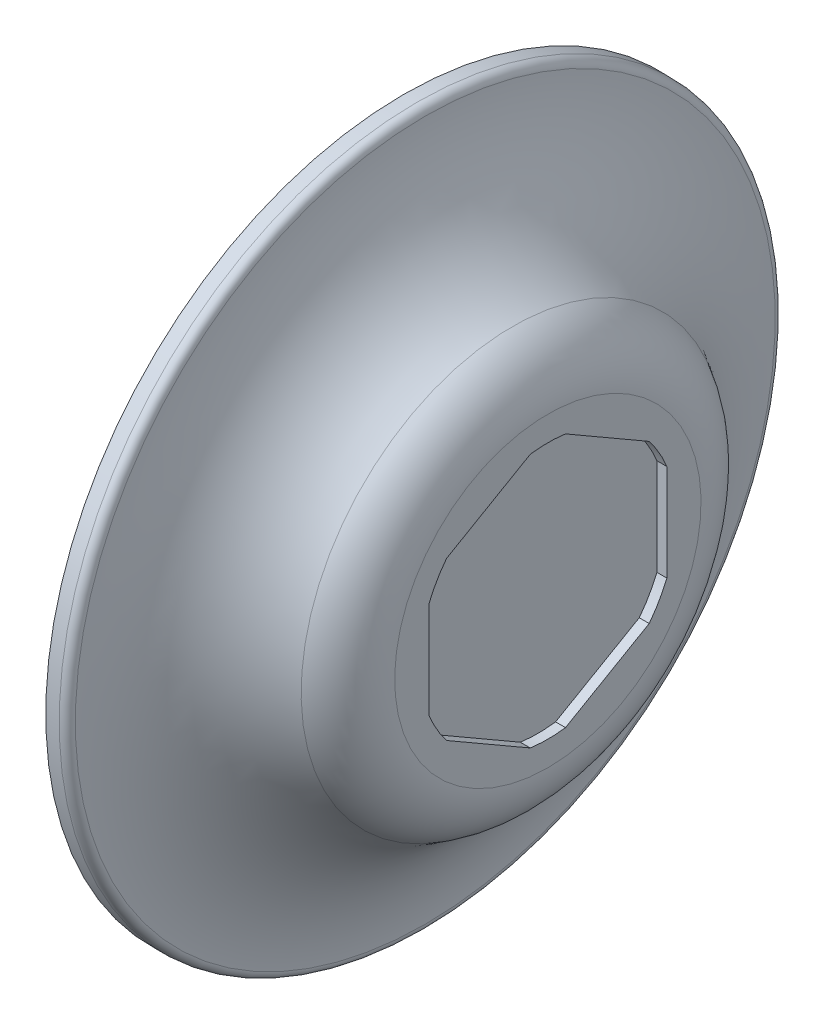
from build123d import *

# Parameters (mm, degrees)
HEX_2_DEPTH       = 0.762
SKETCH4_R         = 12.2555
BACK_RECESS_DEPTH = 0.7493
FILLET1_R         = 0.635


with BuildPart() as part:
    # Sketch1 → Main Body (revolve)
    with BuildSketch(Plane.XY, mode=Mode.PRIVATE) as main_body_sk:
        with BuildLine():
            Line((6.949434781, 0), (9.413234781, 0))
            Line((9.413234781, 0), (9.413234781, 11.743608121))
            ThreePointArc((9.413234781, 11.743608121), (8.689274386, 14.357287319), (6.723739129, 16.2260058))
            ThreePointArc((6.723739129, 16.2260058), (1.809900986, 20.897802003), (0, 27.432))
            Line((0, 27.432), (-1.651, 27.432))
            Line((-1.651, 27.432), (-1.651, 26.162))
            Line((-1.651, 26.162), (-0.395763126, 26.162))
            ThreePointArc((-0.395763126, 26.162), (1.897435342, 19.920907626), (6.949434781, 15.598027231))
            Line((6.949434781, 15.598027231), (6.949434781, 0))
        make_face()
    revolve(main_body_sk.sketch.rotate(Axis((6.949434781, 0, 0), (1, 0, 0)), 180), axis=Axis((6.949434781, 0, 0), (1, 0, 0)))

    # Sketch3 → Hex 2 (cut)
    with BuildSketch(Plane(origin=(9.413234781, 0, 0), x_dir=(0, 0, -1), z_dir=(1, 0, 0))):
        with BuildLine():
            Line((-9.1186, 3.704853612), (-9.1186, -3.704853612))
            ThreePointArc((-9.1186, -3.704853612), (-8.523855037, -4.92125), (-7.767797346, -6.044512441))
            Line((-7.767797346, -6.044512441), (-1.350802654, -9.749366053))
            ThreePointArc((-1.350802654, -9.749366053), (0, -9.8425), (1.350802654, -9.749366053))
            Line((1.350802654, -9.749366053), (7.767797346, -6.044512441))
            ThreePointArc((7.767797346, -6.044512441), (8.523855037, -4.92125), (9.1186, -3.704853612))
            Line((9.1186, -3.704853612), (9.1186, 3.704853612))
            ThreePointArc((9.1186, 3.704853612), (8.523855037, 4.92125), (7.767797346, 6.044512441))
            Line((7.767797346, 6.044512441), (1.350802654, 9.749366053))
            ThreePointArc((1.350802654, 9.749366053), (0, 9.8425), (-1.350802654, 9.749366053))
            Line((-1.350802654, 9.749366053), (-7.767797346, 6.044512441))
            ThreePointArc((-7.767797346, 6.044512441), (-8.523855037, 4.92125), (-9.1186, 3.704853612))
        make_face()
    extrude(amount=-HEX_2_DEPTH, mode=Mode.SUBTRACT)

    # Sketch4 → Back Recess (cut)
    with BuildSketch(Plane.ZY.offset(-6.949434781)):
        with Locations(Location((0, 0, 0), (0, 0, 270))):
            Circle(SKETCH4_R)
    extrude(amount=-BACK_RECESS_DEPTH, mode=Mode.SUBTRACT)

    # Fillet1
    fillet1_edges = [part.edges().sort_by_distance(p)[0] for p in [
        (0, 27.432, 0),
    ]]
    fillet(fillet1_edges, radius=FILLET1_R)


solid = part.part
